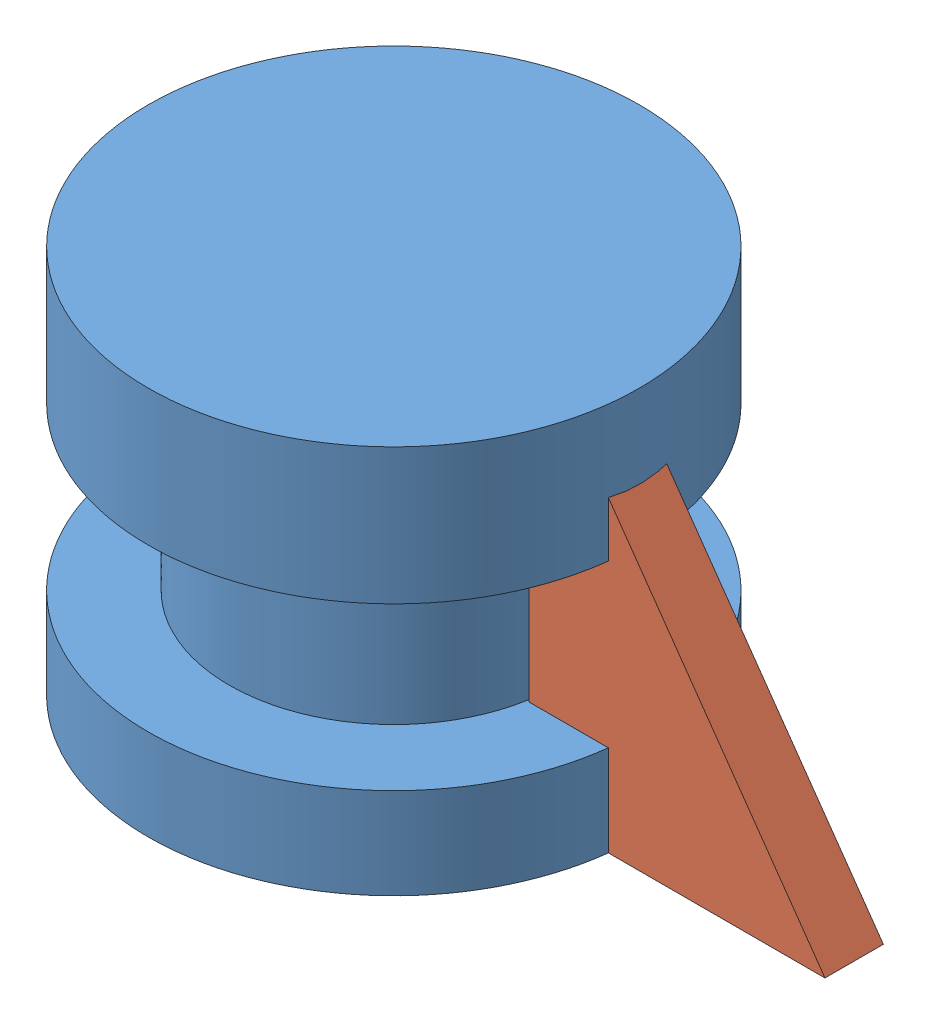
SolidWorks assembly SZPULKA Z ZEBREM.SLDASM, configuration Standard (file format 3400). Lengths in mm.
Overall size (120.88 69.78 84.08).
2 component instances, 2 part files, 2 mates.
Components (placement in the parent):
- SZPULKA 0-1: SZPULKA 0.SLDPRT [Standard] at origin size (120.88 69.78 84.08)
- ZEBRO 0-1: ZEBRO 0.SLDPRT [Standard] at origin size (80.06 69.78 10)
Mates (geometry in assembly coordinates):
- Deckungsgleich1: coincident anti-aligned: line of ?; line of ?
- Deckungsgleich2: coincident aligned: line of ?; line of ?
